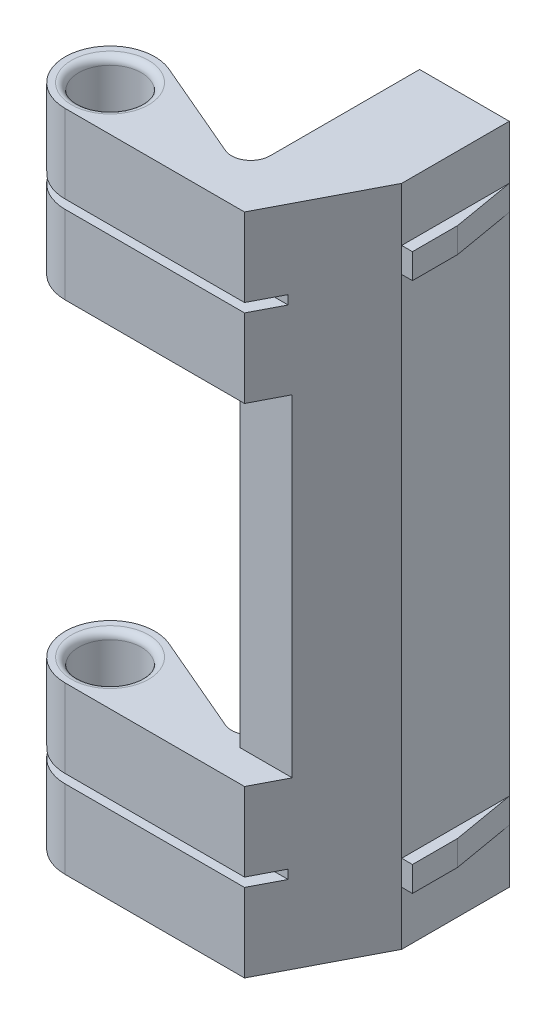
from build123d import *

# Parameters (mm, degrees)
EXTRUDE_1_DEPTH     = 74
SKETCH_2_W          = 66.956207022
SKETCH_2_H          = 37
CUT_EXTRUDE_1_DEPTH = 3.5
SKETCH_3_W          = 36.178534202
SKETCH_3_H          = 37
CUT_EXTRUDE_2_DEPTH = 10
SKETCH_7_W          = 8
SKETCH_7_H          = 22.175181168
EXTRUDE_2_DEPTH     = 2.5
CUT_EXTRUDE_3_DEPTH = 30
SKETCH_9_R          = 3.5
CUT_EXTRUDE_4_DEPTH = 82.576844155
SKETCH_10_W         = 12
SKETCH_10_H         = 2.8
EXTRUDE_3_DEPTH     = 1.2
CUT_EXTRUDE_5_DEPTH = 77.175990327
SKETCH_12_R         = 3
CUT_EXTRUDE_6_DEPTH = 12
CUT_EXTRUDE_7_DEPTH = 12
FILLET_1_R          = 1
FILLET_2_R          = 0.8
SKETCH_14_W         = 35.83498621
SKETCH_14_H         = 1
CUT_EXTRUDE_8_DEPTH = 3.2


with BuildPart() as part:
    # Sketch 1 → Extrude 1 (new body)
    with BuildSketch(Plane(origin=(0, 0, 0), x_dir=(1, 0, 0), z_dir=(0, 1, 0))):
        with BuildLine():
            Line((-4, 23.532562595), (6, 23.532562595))
            Line((6, 23.532562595), (6, 11.532562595))
            Line((6, 11.532562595), (0, 0))
            Line((0, 0), (-20, 0))
            ThreePointArc((-20, 0), (-24.898057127, 6.004508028), (-18.031944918, 9.596385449))
            Line((-18.031944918, 9.596385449), (-7.000619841, 4.873053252))
            ThreePointArc((-7.000619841, 4.873053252), (-4.967548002, 5.05505336), (-4, 6.852372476))
            Line((-4, 6.852372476), (-4, 23.532562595))
        make_face()
    extrude(amount=EXTRUDE_1_DEPTH)

    # Sketch 2 → Cut-Extrude 1 (cut)
    with BuildSketch(Plane.XY):
        with Locations((-12.324752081, 37)):
            Rectangle(SKETCH_2_W, SKETCH_2_H)
    extrude(amount=-CUT_EXTRUDE_1_DEPTH, mode=Mode.SUBTRACT)

    # Sketch 3 → Cut-Extrude 2 (cut)
    with BuildSketch(Plane.XY.offset(-3.5)):
        with Locations((-22.089267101, 37)):
            Rectangle(SKETCH_3_W, SKETCH_3_H)
    extrude(amount=-CUT_EXTRUDE_2_DEPTH, mode=Mode.SUBTRACT)

    # Sketch 7 → Extrude 2 (add)
    with BuildSketch(Plane.ZY.offset(4)):
        with Locations((-19.532562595, 37)):
            Rectangle(SKETCH_7_W, SKETCH_7_H)
    extrude(amount=EXTRUDE_2_DEPTH)

    # Sketch 8 → Cut-Extrude 3 (cut)
    with BuildSketch(Plane.XZ.offset(-25.912409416)):
        Polygon((-6.5, -23.532562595), (-4, -15.532562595), (-6.5, -15.532562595), align=None)
    extrude(amount=-CUT_EXTRUDE_3_DEPTH, mode=Mode.SUBTRACT)

    # Sketch 9 → Cut-Extrude 4 (cut, through all)
    with BuildSketch(Plane(origin=(0, 74, 0), x_dir=(1, 0, 0), z_dir=(0, 1, 0))):
        with Locations(Location((-20, 5, 0), (0, 0, 270))):
            Circle(SKETCH_9_R)
    extrude(amount=-CUT_EXTRUDE_4_DEPTH, mode=Mode.SUBTRACT)

    # Sketch 10 → Extrude 3 (add)
    with BuildSketch(Plane(origin=(6, 0, 0), x_dir=(0, 0, -1), z_dir=(1, 0, 0))):
        with Locations((17.532562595, 66.6)):
            Rectangle(SKETCH_10_W, SKETCH_10_H)
        with Locations((17.532562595, 7.4)):
            Rectangle(SKETCH_10_W, SKETCH_10_H)
    extrude(amount=EXTRUDE_3_DEPTH)

    # Sketch 11 → Cut-Extrude 5 (cut, through all)
    with BuildSketch(Plane.XZ.offset(-6)):
        Polygon((6, -23.532562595), (7.2, -16.572204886), (7.2, -23.532562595), align=None)
    extrude(amount=-CUT_EXTRUDE_5_DEPTH, mode=Mode.SUBTRACT)

    # Sketch 12 → Cut-Extrude 6 (cut)
    with BuildSketch(Plane(origin=(0, 0, -23.532562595), x_dir=(-1, 0, 0), z_dir=(0, 0, -1))):
        with Locations((-1, 37)):
            Circle(SKETCH_12_R)
        with Locations((-1, 62)):
            Circle(SKETCH_12_R)
        with Locations((-1, 12)):
            Circle(SKETCH_12_R)
    extrude(amount=-CUT_EXTRUDE_6_DEPTH, mode=Mode.SUBTRACT)

    # Sketch 13 → Cut-Extrude 7 (cut)
    with BuildSketch(Plane(origin=(0, 0, -23.532562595), x_dir=(-1, 0, 0), z_dir=(0, 0, -1))):
        with BuildLine():
            Line((-5, 73), (3, 73))
            Line((3, 73), (3, 64.061552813))
            ThreePointArc((3, 64.061552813), (-1, 66.5), (-5, 64.061552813))
            Line((-5, 64.061552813), (-5, 73))
        make_face()
        with BuildLine():
            Line((-5, 1), (3, 1))
            Line((3, 1), (3, 9.938447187))
            ThreePointArc((3, 9.938447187), (-1, 7.5), (-5, 9.938447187))
            Line((-5, 9.938447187), (-5, 1))
        make_face()
        with BuildLine():
            Line((3, 33.677350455), (3, 14.061552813))
            ThreePointArc((3, 14.061552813), (-1, 16.5), (-5, 14.061552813))
            Line((-5, 14.061552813), (-5, 33.677350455))
            ThreePointArc((-5, 33.677350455), (-1, 31.8), (3, 33.677350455))
        make_face()
        with BuildLine():
            Line((-5, 59.938447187), (-5, 40.322649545))
            ThreePointArc((-5, 40.322649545), (-1, 42.2), (3, 40.322649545))
            Line((3, 40.322649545), (3, 59.938447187))
            ThreePointArc((3, 59.938447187), (-1, 57.5), (-5, 59.938447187))
        make_face()
    extrude(amount=-CUT_EXTRUDE_7_DEPTH, mode=Mode.SUBTRACT)

    # Fillet 1
    fillet_1_edges = [part.edges().sort_by_distance(p)[0] for p in [
        (4, 37, -23.532562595),
        (4, 62, -23.532562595),
        (4, 12, -23.532562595),
    ]]
    fillet(fillet_1_edges, radius=FILLET_1_R)

    # Fillet 2
    fillet_2_edges = [part.edges().sort_by_distance(p)[0] for p in [
        (-20, 55.5, -8.5),
        (-20, 0, -8.5),
        (-20, 18.5, -8.5),
        (-20, 74, -8.5),
    ]]
    fillet(fillet_2_edges, radius=FILLET_2_R)

    # Sketch 14 → Cut-Extrude 8 (cut)
    with BuildSketch(Plane.XY):
        with Locations((-9.408057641, 9.25)):
            Rectangle(SKETCH_14_W, SKETCH_14_H)
        with Locations((-9.408057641, 64.75)):
            Rectangle(SKETCH_14_W, SKETCH_14_H)
    extrude(amount=-CUT_EXTRUDE_8_DEPTH, mode=Mode.SUBTRACT)


solid = part.part
